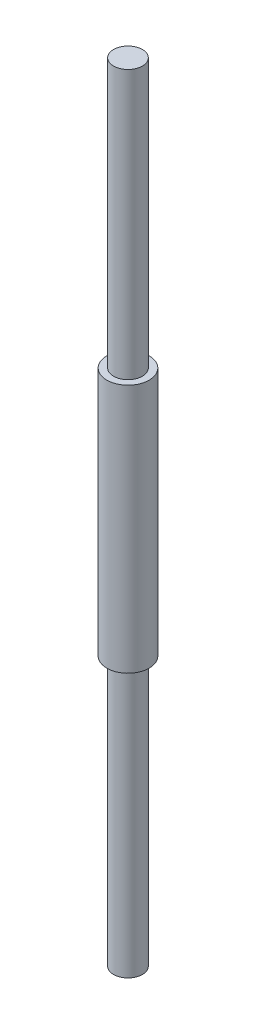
ISO-10303-21;
HEADER;
FILE_DESCRIPTION(('STEP AP214'),'2;1');
FILE_NAME('part.step','',(''),(''),'','','');
FILE_SCHEMA(('AUTOMOTIVE_DESIGN { 1 0 10303 214 1 1 1 1 }'));
ENDSEC;
DATA;
#1=APPLICATION_CONTEXT('core data for automotive mechanical design processes');
#2=APPLICATION_PROTOCOL_DEFINITION('international standard','automotive_design',2000,#1);
#3=PRODUCT_CONTEXT('',#1,'mechanical');
#4=PRODUCT('Part','Part','',(#3));
#5=PRODUCT_RELATED_PRODUCT_CATEGORY('part','',(#4));
#6=PRODUCT_DEFINITION_FORMATION('','',#4);
#7=PRODUCT_DEFINITION_CONTEXT('part definition',#1,'design');
#8=PRODUCT_DEFINITION('design','',#6,#7);
#9=PRODUCT_DEFINITION_SHAPE('','',#8);
#10=(LENGTH_UNIT() NAMED_UNIT(*) SI_UNIT(.MILLI.,.METRE.));
#11=(NAMED_UNIT(*) PLANE_ANGLE_UNIT() SI_UNIT($,.RADIAN.));
#12=(NAMED_UNIT(*) SI_UNIT($,.STERADIAN.) SOLID_ANGLE_UNIT());
#13=UNCERTAINTY_MEASURE_WITH_UNIT(LENGTH_MEASURE(1.E-05),#10,'distance_accuracy_value','');
#14=(GEOMETRIC_REPRESENTATION_CONTEXT(3) GLOBAL_UNCERTAINTY_ASSIGNED_CONTEXT((#13)) GLOBAL_UNIT_ASSIGNED_CONTEXT((#10,
#11,#12)) REPRESENTATION_CONTEXT('',''));
#15=CARTESIAN_POINT('',(0.,0.,0.));
#16=DIRECTION('',(0.,0.,1.));
#17=DIRECTION('',(1.,0.,0.));
#18=AXIS2_PLACEMENT_3D('',#15,#16,#17);
#19=CARTESIAN_POINT('',(0.,177.8,0.));
#20=DIRECTION('',(0.,-1.,0.));
#21=DIRECTION('',(0.,0.,-1.));
#22=AXIS2_PLACEMENT_3D('',#19,#20,#21);
#23=CYLINDRICAL_SURFACE('',#22,9.525);
#24=CARTESIAN_POINT('',(0.,177.8,0.));
#25=DIRECTION('',(0.,1.,0.));
#26=DIRECTION('',(0.,0.,1.));
#27=AXIS2_PLACEMENT_3D('',#24,#25,#26);
#28=CIRCLE('',#27,9.525);
#29=CARTESIAN_POINT('',(0.,177.8,9.525));
#30=VERTEX_POINT('',#29);
#31=EDGE_CURVE('E38',#30,#30,#28,.T.);
#32=ORIENTED_EDGE('',*,*,#31,.F.);
#33=EDGE_LOOP('',(#32));
#34=FACE_BOUND('',#33,.T.);
#35=CARTESIAN_POINT('',(0.,0.,0.));
#36=DIRECTION('',(0.,1.,0.));
#37=DIRECTION('',(0.,0.,1.));
#38=AXIS2_PLACEMENT_3D('',#35,#36,#37);
#39=CIRCLE('',#38,9.525);
#40=CARTESIAN_POINT('',(0.,0.,9.525));
#41=VERTEX_POINT('',#40);
#42=EDGE_CURVE('E34',#41,#41,#39,.T.);
#43=ORIENTED_EDGE('',*,*,#42,.T.);
#44=EDGE_LOOP('',(#43));
#45=FACE_BOUND('',#44,.T.);
#46=ADVANCED_FACE('F31',(#34,#45),#23,.T.);
#47=CARTESIAN_POINT('',(0.,0.,0.));
#48=DIRECTION('',(0.,1.,0.));
#49=DIRECTION('',(0.,0.,1.));
#50=AXIS2_PLACEMENT_3D('',#47,#48,#49);
#51=PLANE('',#50);
#52=ORIENTED_EDGE('',*,*,#42,.F.);
#53=EDGE_LOOP('',(#52));
#54=FACE_BOUND('',#53,.T.);
#55=ADVANCED_FACE('F72',(#54),#51,.F.);
#56=CARTESIAN_POINT('',(0.,342.9,0.));
#57=DIRECTION('',(0.,-1.,0.));
#58=DIRECTION('',(0.,0.,-1.));
#59=AXIS2_PLACEMENT_3D('',#56,#57,#58);
#60=CYLINDRICAL_SURFACE('',#59,13.97);
#61=CARTESIAN_POINT('',(0.,342.9,0.));
#62=DIRECTION('',(0.,1.,0.));
#63=DIRECTION('',(0.,0.,1.));
#64=AXIS2_PLACEMENT_3D('',#61,#62,#63);
#65=CIRCLE('',#64,13.97);
#66=CARTESIAN_POINT('',(0.,342.9,13.97));
#67=VERTEX_POINT('',#66);
#68=EDGE_CURVE('E46',#67,#67,#65,.T.);
#69=ORIENTED_EDGE('',*,*,#68,.F.);
#70=EDGE_LOOP('',(#69));
#71=FACE_BOUND('',#70,.T.);
#72=CARTESIAN_POINT('',(0.,177.8,0.));
#73=DIRECTION('',(0.,1.,0.));
#74=DIRECTION('',(0.,0.,1.));
#75=AXIS2_PLACEMENT_3D('',#72,#73,#74);
#76=CIRCLE('',#75,13.97);
#77=CARTESIAN_POINT('',(0.,177.8,13.97));
#78=VERTEX_POINT('',#77);
#79=EDGE_CURVE('E49',#78,#78,#76,.T.);
#80=ORIENTED_EDGE('',*,*,#79,.T.);
#81=EDGE_LOOP('',(#80));
#82=FACE_BOUND('',#81,.T.);
#83=ADVANCED_FACE('F77',(#71,#82),#60,.T.);
#84=CARTESIAN_POINT('',(0.,342.9,0.));
#85=DIRECTION('',(0.,1.,0.));
#86=DIRECTION('',(0.,0.,1.));
#87=AXIS2_PLACEMENT_3D('',#84,#85,#86);
#88=PLANE('',#87);
#89=CARTESIAN_POINT('',(0.,342.9,0.));
#90=DIRECTION('',(0.,1.,0.));
#91=DIRECTION('',(0.,0.,1.));
#92=AXIS2_PLACEMENT_3D('',#89,#90,#91);
#93=CIRCLE('',#92,9.525);
#94=CARTESIAN_POINT('',(0.,342.9,9.525));
#95=VERTEX_POINT('',#94);
#96=EDGE_CURVE('E10',#95,#95,#93,.T.);
#97=ORIENTED_EDGE('',*,*,#96,.F.);
#98=EDGE_LOOP('',(#97));
#99=FACE_BOUND('',#98,.T.);
#100=ORIENTED_EDGE('',*,*,#68,.T.);
#101=EDGE_LOOP('',(#100));
#102=FACE_BOUND('',#101,.T.);
#103=ADVANCED_FACE('F67',(#99,#102),#88,.T.);
#104=CARTESIAN_POINT('',(0.,177.8,0.));
#105=DIRECTION('',(0.,1.,0.));
#106=DIRECTION('',(0.,0.,1.));
#107=AXIS2_PLACEMENT_3D('',#104,#105,#106);
#108=PLANE('',#107);
#109=ORIENTED_EDGE('',*,*,#31,.T.);
#110=EDGE_LOOP('',(#109));
#111=FACE_BOUND('',#110,.T.);
#112=ORIENTED_EDGE('',*,*,#79,.F.);
#113=EDGE_LOOP('',(#112));
#114=FACE_BOUND('',#113,.T.);
#115=ADVANCED_FACE('F60',(#111,#114),#108,.F.);
#116=CARTESIAN_POINT('',(0.,520.7,0.));
#117=DIRECTION('',(0.,-1.,0.));
#118=DIRECTION('',(0.,0.,-1.));
#119=AXIS2_PLACEMENT_3D('',#116,#117,#118);
#120=CYLINDRICAL_SURFACE('',#119,9.525);
#121=CARTESIAN_POINT('',(0.,520.7,0.));
#122=DIRECTION('',(0.,1.,0.));
#123=DIRECTION('',(0.,0.,1.));
#124=AXIS2_PLACEMENT_3D('',#121,#122,#123);
#125=CIRCLE('',#124,9.525);
#126=CARTESIAN_POINT('',(0.,520.7,9.525));
#127=VERTEX_POINT('',#126);
#128=EDGE_CURVE('E45',#127,#127,#125,.T.);
#129=ORIENTED_EDGE('',*,*,#128,.F.);
#130=EDGE_LOOP('',(#129));
#131=FACE_BOUND('',#130,.T.);
#132=ORIENTED_EDGE('',*,*,#96,.T.);
#133=EDGE_LOOP('',(#132));
#134=FACE_BOUND('',#133,.T.);
#135=ADVANCED_FACE('F58',(#131,#134),#120,.T.);
#136=CARTESIAN_POINT('',(0.,520.7,0.));
#137=DIRECTION('',(0.,1.,0.));
#138=DIRECTION('',(0.,0.,1.));
#139=AXIS2_PLACEMENT_3D('',#136,#137,#138);
#140=PLANE('',#139);
#141=ORIENTED_EDGE('',*,*,#128,.T.);
#142=EDGE_LOOP('',(#141));
#143=FACE_BOUND('',#142,.T.);
#144=ADVANCED_FACE('F56',(#143),#140,.T.);
#145=CLOSED_SHELL('',(#46,#55,#83,#103,#115,#135,#144));
#146=MANIFOLD_SOLID_BREP('B2',#145);
#147=ADVANCED_BREP_SHAPE_REPRESENTATION('',(#18,#146),#14);
#148=SHAPE_DEFINITION_REPRESENTATION(#9,#147);
ENDSEC;
END-ISO-10303-21;
